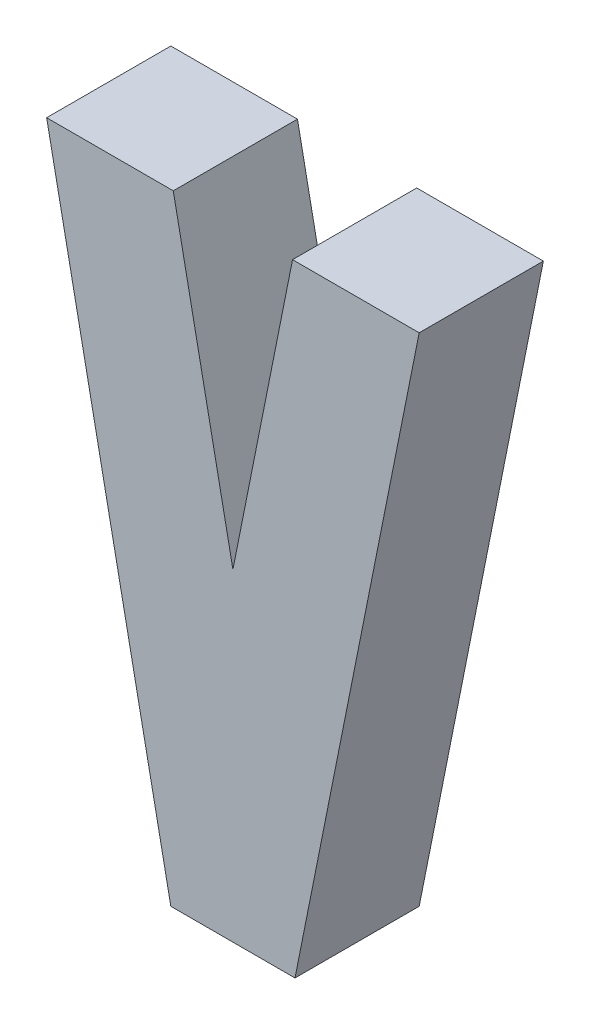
ISO-10303-21;
HEADER;
FILE_DESCRIPTION(('STEP AP214'),'2;1');
FILE_NAME('part.step','',(''),(''),'','','');
FILE_SCHEMA(('AUTOMOTIVE_DESIGN { 1 0 10303 214 1 1 1 1 }'));
ENDSEC;
DATA;
#1=APPLICATION_CONTEXT('core data for automotive mechanical design processes');
#2=APPLICATION_PROTOCOL_DEFINITION('international standard','automotive_design',2000,#1);
#3=PRODUCT_CONTEXT('',#1,'mechanical');
#4=PRODUCT('Part','Part','',(#3));
#5=PRODUCT_RELATED_PRODUCT_CATEGORY('part','',(#4));
#6=PRODUCT_DEFINITION_FORMATION('','',#4);
#7=PRODUCT_DEFINITION_CONTEXT('part definition',#1,'design');
#8=PRODUCT_DEFINITION('design','',#6,#7);
#9=PRODUCT_DEFINITION_SHAPE('','',#8);
#10=(LENGTH_UNIT() NAMED_UNIT(*) SI_UNIT(.MILLI.,.METRE.));
#11=(NAMED_UNIT(*) PLANE_ANGLE_UNIT() SI_UNIT($,.RADIAN.));
#12=(NAMED_UNIT(*) SI_UNIT($,.STERADIAN.) SOLID_ANGLE_UNIT());
#13=UNCERTAINTY_MEASURE_WITH_UNIT(LENGTH_MEASURE(1.E-05),#10,'distance_accuracy_value','');
#14=(GEOMETRIC_REPRESENTATION_CONTEXT(3) GLOBAL_UNCERTAINTY_ASSIGNED_CONTEXT((#13)) GLOBAL_UNIT_ASSIGNED_CONTEXT((#10,
#11,#12)) REPRESENTATION_CONTEXT('',''));
#15=CARTESIAN_POINT('',(0.,0.,0.));
#16=DIRECTION('',(0.,0.,1.));
#17=DIRECTION('',(1.,0.,0.));
#18=AXIS2_PLACEMENT_3D('',#15,#16,#17);
#19=CARTESIAN_POINT('',(19.8019609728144,50.,10.));
#20=DIRECTION('',(0.,-1.,0.));
#21=DIRECTION('',(0.,0.,-1.));
#22=AXIS2_PLACEMENT_3D('',#19,#20,#21);
#23=PLANE('',#22);
#24=DIRECTION('',(-1.,0.,0.));
#25=VECTOR('',#24,1.);
#26=CARTESIAN_POINT('',(19.8019609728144,50.,0.));
#27=LINE('',#26,#25);
#28=CARTESIAN_POINT('',(30.,50.,0.));
#29=VERTEX_POINT('',#28);
#30=CARTESIAN_POINT('',(19.8019609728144,50.,0.));
#31=VERTEX_POINT('',#30);
#32=EDGE_CURVE('E123',#29,#31,#27,.T.);
#33=ORIENTED_EDGE('',*,*,#32,.T.);
#34=DIRECTION('',(0.,0.,-1.));
#35=VECTOR('',#34,1.);
#36=CARTESIAN_POINT('',(19.8019609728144,50.,10.));
#37=LINE('',#36,#35);
#38=CARTESIAN_POINT('',(19.8019609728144,50.,10.));
#39=VERTEX_POINT('',#38);
#40=EDGE_CURVE('E11',#39,#31,#37,.T.);
#41=ORIENTED_EDGE('',*,*,#40,.F.);
#42=DIRECTION('',(-1.,0.,0.));
#43=VECTOR('',#42,1.);
#44=CARTESIAN_POINT('',(19.8019609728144,50.,10.));
#45=LINE('',#44,#43);
#46=CARTESIAN_POINT('',(30.,50.,10.));
#47=VERTEX_POINT('',#46);
#48=EDGE_CURVE('E135',#47,#39,#45,.T.);
#49=ORIENTED_EDGE('',*,*,#48,.F.);
#50=DIRECTION('',(0.,0.,-1.));
#51=VECTOR('',#50,1.);
#52=CARTESIAN_POINT('',(30.,50.,10.));
#53=LINE('',#52,#51);
#54=EDGE_CURVE('E119',#47,#29,#53,.T.);
#55=ORIENTED_EDGE('',*,*,#54,.T.);
#56=EDGE_LOOP('',(#33,#41,#49,#55));
#57=FACE_BOUND('',#56,.T.);
#58=ADVANCED_FACE('F33',(#57),#23,.F.);
#59=CARTESIAN_POINT('',(19.8019609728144,50.,10.));
#60=DIRECTION('',(0.98058067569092,-0.196116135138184,0.));
#61=DIRECTION('',(0.196116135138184,0.98058067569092,0.));
#62=AXIS2_PLACEMENT_3D('',#59,#60,#61);
#63=PLANE('',#62);
#64=DIRECTION('',(-0.196116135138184,-0.98058067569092,0.));
#65=VECTOR('',#64,1.);
#66=CARTESIAN_POINT('',(19.8019609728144,50.,0.));
#67=LINE('',#66,#65);
#68=CARTESIAN_POINT('',(15.,25.9901951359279,0.));
#69=VERTEX_POINT('',#68);
#70=EDGE_CURVE('E126',#31,#69,#67,.T.);
#71=ORIENTED_EDGE('',*,*,#70,.T.);
#72=DIRECTION('',(0.,0.,-1.));
#73=VECTOR('',#72,1.);
#74=CARTESIAN_POINT('',(15.,25.9901951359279,10.));
#75=LINE('',#74,#73);
#76=CARTESIAN_POINT('',(15.,25.9901951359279,10.));
#77=VERTEX_POINT('',#76);
#78=EDGE_CURVE('E41',#77,#69,#75,.T.);
#79=ORIENTED_EDGE('',*,*,#78,.F.);
#80=DIRECTION('',(-0.196116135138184,-0.98058067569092,0.));
#81=VECTOR('',#80,1.);
#82=CARTESIAN_POINT('',(19.8019609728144,50.,10.));
#83=LINE('',#82,#81);
#84=EDGE_CURVE('E89',#39,#77,#83,.T.);
#85=ORIENTED_EDGE('',*,*,#84,.F.);
#86=ORIENTED_EDGE('',*,*,#40,.T.);
#87=EDGE_LOOP('',(#71,#79,#85,#86));
#88=FACE_BOUND('',#87,.T.);
#89=ADVANCED_FACE('F160',(#88),#63,.F.);
#90=CARTESIAN_POINT('',(10.1980390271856,50.,10.));
#91=DIRECTION('',(-0.98058067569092,-0.196116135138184,0.));
#92=DIRECTION('',(0.196116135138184,-0.98058067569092,0.));
#93=AXIS2_PLACEMENT_3D('',#90,#91,#92);
#94=PLANE('',#93);
#95=DIRECTION('',(-0.196116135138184,0.98058067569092,0.));
#96=VECTOR('',#95,1.);
#97=CARTESIAN_POINT('',(10.1980390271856,50.,0.));
#98=LINE('',#97,#96);
#99=CARTESIAN_POINT('',(10.1980390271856,50.,0.));
#100=VERTEX_POINT('',#99);
#101=EDGE_CURVE('E128',#69,#100,#98,.T.);
#102=ORIENTED_EDGE('',*,*,#101,.T.);
#103=DIRECTION('',(0.,0.,-1.));
#104=VECTOR('',#103,1.);
#105=CARTESIAN_POINT('',(10.1980390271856,50.,10.));
#106=LINE('',#105,#104);
#107=CARTESIAN_POINT('',(10.1980390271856,50.,10.));
#108=VERTEX_POINT('',#107);
#109=EDGE_CURVE('E139',#108,#100,#106,.T.);
#110=ORIENTED_EDGE('',*,*,#109,.F.);
#111=DIRECTION('',(-0.196116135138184,0.98058067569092,0.));
#112=VECTOR('',#111,1.);
#113=CARTESIAN_POINT('',(10.1980390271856,50.,10.));
#114=LINE('',#113,#112);
#115=EDGE_CURVE('E147',#77,#108,#114,.T.);
#116=ORIENTED_EDGE('',*,*,#115,.F.);
#117=ORIENTED_EDGE('',*,*,#78,.T.);
#118=EDGE_LOOP('',(#102,#110,#116,#117));
#119=FACE_BOUND('',#118,.T.);
#120=ADVANCED_FACE('F145',(#119),#94,.F.);
#121=CARTESIAN_POINT('',(0.,50.,10.));
#122=DIRECTION('',(0.,-1.,0.));
#123=DIRECTION('',(0.,0.,-1.));
#124=AXIS2_PLACEMENT_3D('',#121,#122,#123);
#125=PLANE('',#124);
#126=DIRECTION('',(-1.,0.,0.));
#127=VECTOR('',#126,1.);
#128=CARTESIAN_POINT('',(0.,50.,0.));
#129=LINE('',#128,#127);
#130=CARTESIAN_POINT('',(0.,50.,0.));
#131=VERTEX_POINT('',#130);
#132=EDGE_CURVE('E130',#100,#131,#129,.T.);
#133=ORIENTED_EDGE('',*,*,#132,.T.);
#134=DIRECTION('',(0.,0.,-1.));
#135=VECTOR('',#134,1.);
#136=CARTESIAN_POINT('',(0.,50.,10.));
#137=LINE('',#136,#135);
#138=CARTESIAN_POINT('',(0.,50.,10.));
#139=VERTEX_POINT('',#138);
#140=EDGE_CURVE('E114',#139,#131,#137,.T.);
#141=ORIENTED_EDGE('',*,*,#140,.F.);
#142=DIRECTION('',(-1.,0.,0.));
#143=VECTOR('',#142,1.);
#144=CARTESIAN_POINT('',(0.,50.,10.));
#145=LINE('',#144,#143);
#146=EDGE_CURVE('E105',#108,#139,#145,.T.);
#147=ORIENTED_EDGE('',*,*,#146,.F.);
#148=ORIENTED_EDGE('',*,*,#109,.T.);
#149=EDGE_LOOP('',(#133,#141,#147,#148));
#150=FACE_BOUND('',#149,.T.);
#151=ADVANCED_FACE('F153',(#150),#125,.F.);
#152=CARTESIAN_POINT('',(0.,50.,10.));
#153=DIRECTION('',(0.98058067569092,0.196116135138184,0.));
#154=DIRECTION('',(-0.196116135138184,0.98058067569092,0.));
#155=AXIS2_PLACEMENT_3D('',#152,#153,#154);
#156=PLANE('',#155);
#157=DIRECTION('',(0.196116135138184,-0.98058067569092,0.));
#158=VECTOR('',#157,1.);
#159=CARTESIAN_POINT('',(0.,50.,0.));
#160=LINE('',#159,#158);
#161=CARTESIAN_POINT('',(10.,0.,0.));
#162=VERTEX_POINT('',#161);
#163=EDGE_CURVE('E113',#131,#162,#160,.T.);
#164=ORIENTED_EDGE('',*,*,#163,.T.);
#165=DIRECTION('',(0.,0.,-1.));
#166=VECTOR('',#165,1.);
#167=CARTESIAN_POINT('',(10.,0.,10.));
#168=LINE('',#167,#166);
#169=CARTESIAN_POINT('',(10.,0.,10.));
#170=VERTEX_POINT('',#169);
#171=EDGE_CURVE('E110',#170,#162,#168,.T.);
#172=ORIENTED_EDGE('',*,*,#171,.F.);
#173=DIRECTION('',(0.196116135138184,-0.98058067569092,0.));
#174=VECTOR('',#173,1.);
#175=CARTESIAN_POINT('',(0.,50.,10.));
#176=LINE('',#175,#174);
#177=EDGE_CURVE('E99',#139,#170,#176,.T.);
#178=ORIENTED_EDGE('',*,*,#177,.F.);
#179=ORIENTED_EDGE('',*,*,#140,.T.);
#180=EDGE_LOOP('',(#164,#172,#178,#179));
#181=FACE_BOUND('',#180,.T.);
#182=ADVANCED_FACE('F111',(#181),#156,.F.);
#183=CARTESIAN_POINT('',(10.,0.,10.));
#184=DIRECTION('',(0.,1.,0.));
#185=DIRECTION('',(0.,0.,1.));
#186=AXIS2_PLACEMENT_3D('',#183,#184,#185);
#187=PLANE('',#186);
#188=DIRECTION('',(1.,0.,0.));
#189=VECTOR('',#188,1.);
#190=CARTESIAN_POINT('',(10.,0.,0.));
#191=LINE('',#190,#189);
#192=CARTESIAN_POINT('',(20.,0.,0.));
#193=VERTEX_POINT('',#192);
#194=EDGE_CURVE('E75',#162,#193,#191,.T.);
#195=ORIENTED_EDGE('',*,*,#194,.T.);
#196=DIRECTION('',(0.,0.,-1.));
#197=VECTOR('',#196,1.);
#198=CARTESIAN_POINT('',(20.,0.,10.));
#199=LINE('',#198,#197);
#200=CARTESIAN_POINT('',(20.,0.,10.));
#201=VERTEX_POINT('',#200);
#202=EDGE_CURVE('E115',#201,#193,#199,.T.);
#203=ORIENTED_EDGE('',*,*,#202,.F.);
#204=DIRECTION('',(1.,0.,0.));
#205=VECTOR('',#204,1.);
#206=CARTESIAN_POINT('',(10.,0.,10.));
#207=LINE('',#206,#205);
#208=EDGE_CURVE('E103',#170,#201,#207,.T.);
#209=ORIENTED_EDGE('',*,*,#208,.F.);
#210=ORIENTED_EDGE('',*,*,#171,.T.);
#211=EDGE_LOOP('',(#195,#203,#209,#210));
#212=FACE_BOUND('',#211,.T.);
#213=ADVANCED_FACE('F117',(#212),#187,.F.);
#214=CARTESIAN_POINT('',(30.,50.,10.));
#215=DIRECTION('',(-0.98058067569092,0.196116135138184,0.));
#216=DIRECTION('',(-0.196116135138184,-0.98058067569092,0.));
#217=AXIS2_PLACEMENT_3D('',#214,#215,#216);
#218=PLANE('',#217);
#219=DIRECTION('',(0.196116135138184,0.98058067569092,0.));
#220=VECTOR('',#219,1.);
#221=CARTESIAN_POINT('',(30.,50.,0.));
#222=LINE('',#221,#220);
#223=EDGE_CURVE('E81',#193,#29,#222,.T.);
#224=ORIENTED_EDGE('',*,*,#223,.T.);
#225=ORIENTED_EDGE('',*,*,#54,.F.);
#226=DIRECTION('',(0.196116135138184,0.98058067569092,0.));
#227=VECTOR('',#226,1.);
#228=CARTESIAN_POINT('',(30.,50.,10.));
#229=LINE('',#228,#227);
#230=EDGE_CURVE('E49',#201,#47,#229,.T.);
#231=ORIENTED_EDGE('',*,*,#230,.F.);
#232=ORIENTED_EDGE('',*,*,#202,.T.);
#233=EDGE_LOOP('',(#224,#225,#231,#232));
#234=FACE_BOUND('',#233,.T.);
#235=ADVANCED_FACE('F174',(#234),#218,.F.);
#236=CARTESIAN_POINT('',(0.,0.,10.));
#237=DIRECTION('',(0.,0.,-1.));
#238=DIRECTION('',(-1.,0.,0.));
#239=AXIS2_PLACEMENT_3D('',#236,#237,#238);
#240=PLANE('',#239);
#241=ORIENTED_EDGE('',*,*,#48,.T.);
#242=ORIENTED_EDGE('',*,*,#84,.T.);
#243=ORIENTED_EDGE('',*,*,#115,.T.);
#244=ORIENTED_EDGE('',*,*,#146,.T.);
#245=ORIENTED_EDGE('',*,*,#177,.T.);
#246=ORIENTED_EDGE('',*,*,#208,.T.);
#247=ORIENTED_EDGE('',*,*,#230,.T.);
#248=EDGE_LOOP('',(#241,#242,#243,#244,#245,#246,#247));
#249=FACE_BOUND('',#248,.T.);
#250=ADVANCED_FACE('F101',(#249),#240,.F.);
#251=CARTESIAN_POINT('',(0.,0.,0.));
#252=DIRECTION('',(0.,0.,-1.));
#253=DIRECTION('',(-1.,0.,0.));
#254=AXIS2_PLACEMENT_3D('',#251,#252,#253);
#255=PLANE('',#254);
#256=ORIENTED_EDGE('',*,*,#32,.F.);
#257=ORIENTED_EDGE('',*,*,#223,.F.);
#258=ORIENTED_EDGE('',*,*,#194,.F.);
#259=ORIENTED_EDGE('',*,*,#163,.F.);
#260=ORIENTED_EDGE('',*,*,#132,.F.);
#261=ORIENTED_EDGE('',*,*,#101,.F.);
#262=ORIENTED_EDGE('',*,*,#70,.F.);
#263=EDGE_LOOP('',(#256,#257,#258,#259,#260,#261,#262));
#264=FACE_BOUND('',#263,.T.);
#265=ADVANCED_FACE('F151',(#264),#255,.T.);
#266=CLOSED_SHELL('',(#58,#89,#120,#151,#182,#213,#235,#250,#265));
#267=MANIFOLD_SOLID_BREP('B2',#266);
#268=ADVANCED_BREP_SHAPE_REPRESENTATION('',(#18,#267),#14);
#269=SHAPE_DEFINITION_REPRESENTATION(#9,#268);
ENDSEC;
END-ISO-10303-21;
